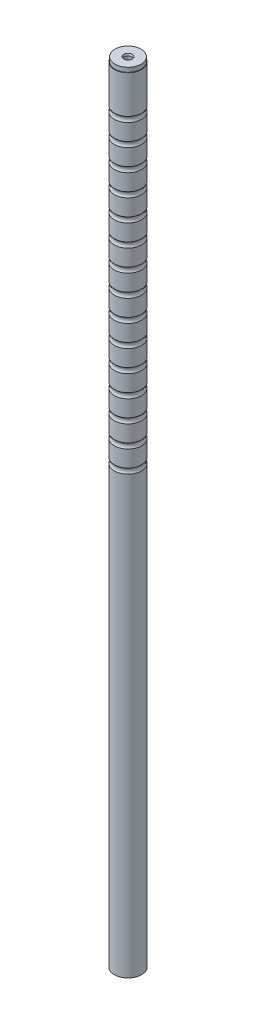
from build123d import *

# Parameters (mm, degrees)
SKETCH1_R                         = 7.9375
EXTRUDE1_DEPTH                    = 460.248
F_10_32_TAPPED_HOLE1_D            = 4.0386
F_10_32_TAPPED_HOLE1_DEPTH        = 13.716
F_10_32_TAPPED_HOLE1_CSINK_D      = 4.8514
F_10_32_TAPPED_HOLE1_CSINK_ANGLE  = 45
F_10_32_TAPPED_HOLE1_TIP          = 1.213317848
F_1_4_20_TAPPED_HOLE1_D           = 5.1054
F_1_4_20_TAPPED_HOLE1_DEPTH       = 19.05
F_1_4_20_TAPPED_HOLE1_CSINK_D     = 6.604
F_1_4_20_TAPPED_HOLE1_CSINK_ANGLE = 45
F_1_4_20_TAPPED_HOLE1_TIP         = 1.533816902
SKETCH6_R                         = 2.38125
LPATTERN1_COUNT                   = 15
LPATTERN1_PITCH                   = 12.7
SKETCH8_OUTSIDE_W                 = 110.034
SKETCH8_OUTSIDE_H                 = 110.034
SKETCH8_OUTSIDE_R                 = 7.62
CUT_EXTRUDE2_DEPTH                = 2.54


with BuildPart() as part:
    # Sketch1 → Extrude1 (new body)
    with BuildSketch(Plane(origin=(0, 0, 0), x_dir=(1, 0, 0), z_dir=(0, 1, 0))):
        with Locations(Location((0, 0, 0), (0, 0, 90))):
            Circle(SKETCH1_R)
    extrude(amount=EXTRUDE1_DEPTH)

    # 10-32 Tapped Hole1
    with Locations(Plane.ZX.offset(460.248)):
        with Locations((0, 0)):
            CounterSinkHole(F_10_32_TAPPED_HOLE1_D / 2, F_10_32_TAPPED_HOLE1_CSINK_D / 2, depth=F_10_32_TAPPED_HOLE1_DEPTH, counter_sink_angle=F_10_32_TAPPED_HOLE1_CSINK_ANGLE)
            with Locations((0, 0, -(F_10_32_TAPPED_HOLE1_DEPTH + F_10_32_TAPPED_HOLE1_TIP / 2))):  # 118° drill point
                Cone(0, F_10_32_TAPPED_HOLE1_D / 2, F_10_32_TAPPED_HOLE1_TIP, mode=Mode.SUBTRACT)

    # 1_4-20 Tapped Hole1
    with Locations(Plane(origin=(0, 0, 0), x_dir=(0, 0, -1), z_dir=(0, -1, 0))):
        with Locations((0, 0)):
            CounterSinkHole(F_1_4_20_TAPPED_HOLE1_D / 2, F_1_4_20_TAPPED_HOLE1_CSINK_D / 2, depth=F_1_4_20_TAPPED_HOLE1_DEPTH, counter_sink_angle=F_1_4_20_TAPPED_HOLE1_CSINK_ANGLE)
            with Locations((0, 0, -(F_1_4_20_TAPPED_HOLE1_DEPTH + F_1_4_20_TAPPED_HOLE1_TIP / 2))):  # 118° drill point
                Cone(0, F_1_4_20_TAPPED_HOLE1_D / 2, F_1_4_20_TAPPED_HOLE1_TIP, mode=Mode.SUBTRACT)

    # Sketch6 → Cut-Revolve1 (revolve, cut)
    with BuildSketch(Plane.XY, mode=Mode.PRIVATE) as cut_revolve1_sk:
        with Locations((9.74725, 434.086)):
            Circle(SKETCH6_R)
    cut_revolve1 = revolve(cut_revolve1_sk.sketch.rotate(Axis((0, 460.248, 0), (0, -1, 0)), 270), axis=Axis((0, 460.248, 0), (0, -1, 0)), mode=Mode.SUBTRACT)

    # LPattern1: Cut-Revolve1 ×15
    with Locations(*[(0, -i * LPATTERN1_PITCH, 0) for i in range(1, LPATTERN1_COUNT)]):
        add(cut_revolve1, mode=Mode.SUBTRACT)

    # Sketch8 outside → Cut-Extrude2 (cut)
    with BuildSketch(Plane(origin=(0, 460.248, 0), x_dir=(1, 0, 0), z_dir=(0, 1, 0))):
        Rectangle(SKETCH8_OUTSIDE_W, SKETCH8_OUTSIDE_H)
        with Locations(Location((0, 0, 0), (0, 0, 270))):
            Circle(SKETCH8_OUTSIDE_R, mode=Mode.SUBTRACT)
    extrude(amount=-CUT_EXTRUDE2_DEPTH, mode=Mode.SUBTRACT)


solid = part.part
